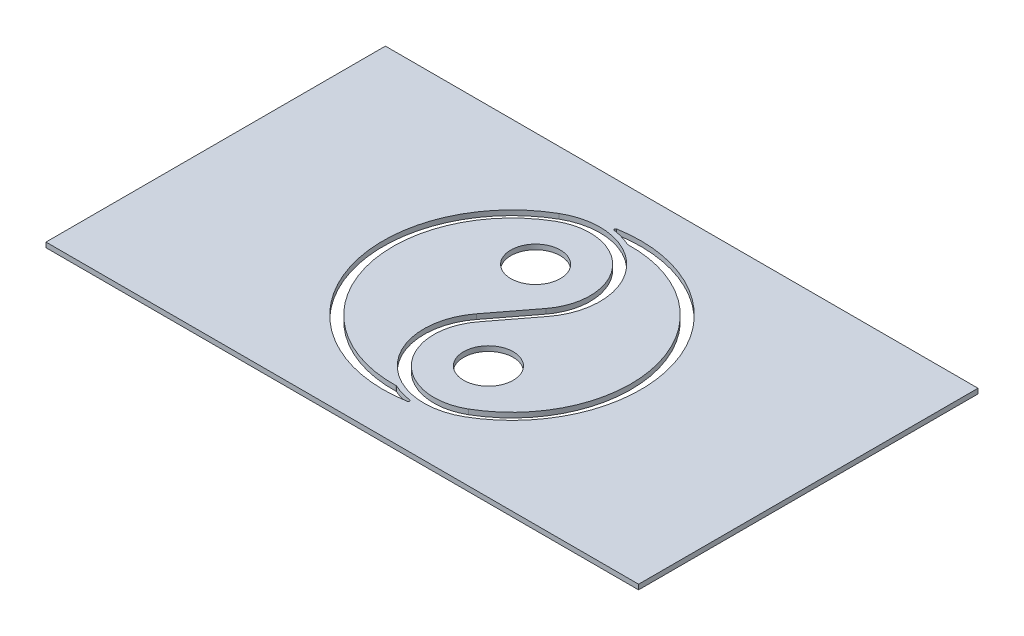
ISO-10303-21;
HEADER;
FILE_DESCRIPTION(('STEP AP214'),'2;1');
FILE_NAME('part.step','',(''),(''),'','','');
FILE_SCHEMA(('AUTOMOTIVE_DESIGN { 1 0 10303 214 1 1 1 1 }'));
ENDSEC;
DATA;
#1=APPLICATION_CONTEXT('core data for automotive mechanical design processes');
#2=APPLICATION_PROTOCOL_DEFINITION('international standard','automotive_design',2000,#1);
#3=PRODUCT_CONTEXT('',#1,'mechanical');
#4=PRODUCT('Part','Part','',(#3));
#5=PRODUCT_RELATED_PRODUCT_CATEGORY('part','',(#4));
#6=PRODUCT_DEFINITION_FORMATION('','',#4);
#7=PRODUCT_DEFINITION_CONTEXT('part definition',#1,'design');
#8=PRODUCT_DEFINITION('design','',#6,#7);
#9=PRODUCT_DEFINITION_SHAPE('','',#8);
#10=(LENGTH_UNIT() NAMED_UNIT(*) SI_UNIT(.MILLI.,.METRE.));
#11=(NAMED_UNIT(*) PLANE_ANGLE_UNIT() SI_UNIT($,.RADIAN.));
#12=(NAMED_UNIT(*) SI_UNIT($,.STERADIAN.) SOLID_ANGLE_UNIT());
#13=UNCERTAINTY_MEASURE_WITH_UNIT(LENGTH_MEASURE(1.E-05),#10,'distance_accuracy_value','');
#14=(GEOMETRIC_REPRESENTATION_CONTEXT(3) GLOBAL_UNCERTAINTY_ASSIGNED_CONTEXT((#13)) GLOBAL_UNIT_ASSIGNED_CONTEXT((#10,
#11,#12)) REPRESENTATION_CONTEXT('',''));
#15=CARTESIAN_POINT('',(0.,0.,0.));
#16=DIRECTION('',(0.,0.,1.));
#17=DIRECTION('',(1.,0.,0.));
#18=AXIS2_PLACEMENT_3D('',#15,#16,#17);
#19=CARTESIAN_POINT('',(0.,1.,0.));
#20=DIRECTION('',(1.,0.,0.));
#21=DIRECTION('',(0.,0.,-1.));
#22=AXIS2_PLACEMENT_3D('',#19,#20,#21);
#23=PLANE('',#22);
#24=DIRECTION('',(0.,0.,1.));
#25=VECTOR('',#24,1.);
#26=CARTESIAN_POINT('',(0.,0.,0.));
#27=LINE('',#26,#25);
#28=CARTESIAN_POINT('',(0.,0.,-68.4505998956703));
#29=VERTEX_POINT('',#28);
#30=CARTESIAN_POINT('',(0.,0.,0.));
#31=VERTEX_POINT('',#30);
#32=EDGE_CURVE('E276',#29,#31,#27,.T.);
#33=ORIENTED_EDGE('',*,*,#32,.T.);
#34=DIRECTION('',(0.,-1.,0.));
#35=VECTOR('',#34,1.);
#36=CARTESIAN_POINT('',(0.,1.,0.));
#37=LINE('',#36,#35);
#38=CARTESIAN_POINT('',(0.,1.,0.));
#39=VERTEX_POINT('',#38);
#40=EDGE_CURVE('E303',#39,#31,#37,.T.);
#41=ORIENTED_EDGE('',*,*,#40,.F.);
#42=DIRECTION('',(0.,0.,1.));
#43=VECTOR('',#42,1.);
#44=CARTESIAN_POINT('',(0.,1.,0.));
#45=LINE('',#44,#43);
#46=CARTESIAN_POINT('',(0.,1.,-68.4505998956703));
#47=VERTEX_POINT('',#46);
#48=EDGE_CURVE('E285',#47,#39,#45,.T.);
#49=ORIENTED_EDGE('',*,*,#48,.F.);
#50=DIRECTION('',(0.,-1.,0.));
#51=VECTOR('',#50,1.);
#52=CARTESIAN_POINT('',(0.,1.,-68.4505998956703));
#53=LINE('',#52,#51);
#54=EDGE_CURVE('E294',#47,#29,#53,.T.);
#55=ORIENTED_EDGE('',*,*,#54,.T.);
#56=EDGE_LOOP('',(#33,#41,#49,#55));
#57=FACE_BOUND('',#56,.T.);
#58=ADVANCED_FACE('F33',(#57),#23,.F.);
#59=CARTESIAN_POINT('',(0.,1.,0.));
#60=DIRECTION('',(0.,0.,-1.));
#61=DIRECTION('',(-1.,0.,0.));
#62=AXIS2_PLACEMENT_3D('',#59,#60,#61);
#63=PLANE('',#62);
#64=DIRECTION('',(1.,0.,0.));
#65=VECTOR('',#64,1.);
#66=CARTESIAN_POINT('',(0.,0.,0.));
#67=LINE('',#66,#65);
#68=CARTESIAN_POINT('',(119.514241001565,0.,0.));
#69=VERTEX_POINT('',#68);
#70=EDGE_CURVE('E279',#31,#69,#67,.T.);
#71=ORIENTED_EDGE('',*,*,#70,.T.);
#72=DIRECTION('',(0.,-1.,0.));
#73=VECTOR('',#72,1.);
#74=CARTESIAN_POINT('',(119.514241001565,1.,0.));
#75=LINE('',#74,#73);
#76=CARTESIAN_POINT('',(119.514241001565,1.,0.));
#77=VERTEX_POINT('',#76);
#78=EDGE_CURVE('E300',#77,#69,#75,.T.);
#79=ORIENTED_EDGE('',*,*,#78,.F.);
#80=DIRECTION('',(1.,0.,0.));
#81=VECTOR('',#80,1.);
#82=CARTESIAN_POINT('',(0.,1.,0.));
#83=LINE('',#82,#81);
#84=EDGE_CURVE('E288',#39,#77,#83,.T.);
#85=ORIENTED_EDGE('',*,*,#84,.F.);
#86=ORIENTED_EDGE('',*,*,#40,.T.);
#87=EDGE_LOOP('',(#71,#79,#85,#86));
#88=FACE_BOUND('',#87,.T.);
#89=ADVANCED_FACE('F364',(#88),#63,.F.);
#90=CARTESIAN_POINT('',(119.514241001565,1.,0.));
#91=DIRECTION('',(-1.,0.,0.));
#92=DIRECTION('',(0.,0.,1.));
#93=AXIS2_PLACEMENT_3D('',#90,#91,#92);
#94=PLANE('',#93);
#95=DIRECTION('',(0.,0.,-1.));
#96=VECTOR('',#95,1.);
#97=CARTESIAN_POINT('',(119.514241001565,0.,0.));
#98=LINE('',#97,#96);
#99=CARTESIAN_POINT('',(119.514241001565,0.,-68.4505998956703));
#100=VERTEX_POINT('',#99);
#101=EDGE_CURVE('E281',#69,#100,#98,.T.);
#102=ORIENTED_EDGE('',*,*,#101,.T.);
#103=DIRECTION('',(0.,-1.,0.));
#104=VECTOR('',#103,1.);
#105=CARTESIAN_POINT('',(119.514241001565,1.,-68.4505998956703));
#106=LINE('',#105,#104);
#107=CARTESIAN_POINT('',(119.514241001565,1.,-68.4505998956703));
#108=VERTEX_POINT('',#107);
#109=EDGE_CURVE('E297',#108,#100,#106,.T.);
#110=ORIENTED_EDGE('',*,*,#109,.F.);
#111=DIRECTION('',(0.,0.,-1.));
#112=VECTOR('',#111,1.);
#113=CARTESIAN_POINT('',(119.514241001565,1.,0.));
#114=LINE('',#113,#112);
#115=EDGE_CURVE('E290',#77,#108,#114,.T.);
#116=ORIENTED_EDGE('',*,*,#115,.F.);
#117=ORIENTED_EDGE('',*,*,#78,.T.);
#118=EDGE_LOOP('',(#102,#110,#116,#117));
#119=FACE_BOUND('',#118,.T.);
#120=ADVANCED_FACE('F369',(#119),#94,.F.);
#121=CARTESIAN_POINT('',(0.,1.,-68.4505998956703));
#122=DIRECTION('',(0.,0.,1.));
#123=DIRECTION('',(1.,0.,0.));
#124=AXIS2_PLACEMENT_3D('',#121,#122,#123);
#125=PLANE('',#124);
#126=DIRECTION('',(-1.,0.,0.));
#127=VECTOR('',#126,1.);
#128=CARTESIAN_POINT('',(0.,0.,-68.4505998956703));
#129=LINE('',#128,#127);
#130=EDGE_CURVE('E283',#100,#29,#129,.T.);
#131=ORIENTED_EDGE('',*,*,#130,.T.);
#132=ORIENTED_EDGE('',*,*,#54,.F.);
#133=DIRECTION('',(-1.,0.,0.));
#134=VECTOR('',#133,1.);
#135=CARTESIAN_POINT('',(0.,1.,-68.4505998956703));
#136=LINE('',#135,#134);
#137=EDGE_CURVE('E292',#108,#47,#136,.T.);
#138=ORIENTED_EDGE('',*,*,#137,.F.);
#139=ORIENTED_EDGE('',*,*,#109,.T.);
#140=EDGE_LOOP('',(#131,#132,#138,#139));
#141=FACE_BOUND('',#140,.T.);
#142=ADVANCED_FACE('F384',(#141),#125,.F.);
#143=CARTESIAN_POINT('',(0.,1.,-68.4505998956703));
#144=DIRECTION('',(0.,-1.,0.));
#145=DIRECTION('',(0.,0.,-1.));
#146=AXIS2_PLACEMENT_3D('',#143,#144,#145);
#147=PLANE('',#146);
#148=DIRECTION('',(0.607100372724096,0.,-0.794625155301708));
#149=VECTOR('',#148,1.);
#150=CARTESIAN_POINT('',(57.5162437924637,1.,-29.6450737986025));
#151=LINE('',#150,#149);
#152=CARTESIAN_POINT('',(57.5162437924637,1.,-29.6450737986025));
#153=VERTEX_POINT('',#152);
#154=CARTESIAN_POINT('',(63.5872475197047,1.,-37.5913253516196));
#155=VERTEX_POINT('',#154);
#156=EDGE_CURVE('E184',#153,#155,#151,.T.);
#157=ORIENTED_EDGE('',*,*,#156,.F.);
#158=CARTESIAN_POINT('',(66.2571205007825,1.,-22.9669696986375));
#159=DIRECTION('',(0.,-1.,0.));
#160=DIRECTION('',(0.,0.,1.));
#161=AXIS2_PLACEMENT_3D('',#158,#159,#160);
#162=CIRCLE('',#161,11.);
#163=CARTESIAN_POINT('',(71.7571205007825,1.,-13.4406902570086));
#164=VERTEX_POINT('',#163);
#165=EDGE_CURVE('E188',#164,#153,#162,.T.);
#166=ORIENTED_EDGE('',*,*,#165,.F.);
#167=CARTESIAN_POINT('',(59.7571205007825,1.,-34.2252999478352));
#168=DIRECTION('',(0.,-1.,0.));
#169=DIRECTION('',(0.,0.,1.));
#170=AXIS2_PLACEMENT_3D('',#167,#168,#169);
#171=CIRCLE('',#170,24.);
#172=CARTESIAN_POINT('',(59.1363829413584,1.,-58.2172712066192));
#173=VERTEX_POINT('',#172);
#174=EDGE_CURVE('E218',#173,#164,#171,.T.);
#175=ORIENTED_EDGE('',*,*,#174,.F.);
#176=CARTESIAN_POINT('',(59.1299169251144,1.,-58.4671875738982));
#177=DIRECTION('',(0.,-1.,0.));
#178=DIRECTION('',(0.,0.,-1.));
#179=AXIS2_PLACEMENT_3D('',#176,#177,#178);
#180=CIRCLE('',#179,0.25);
#181=CARTESIAN_POINT('',(59.026885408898,1.,-58.2394058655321));
#182=VERTEX_POINT('',#181);
#183=EDGE_CURVE('E40',#173,#182,#180,.T.);
#184=ORIENTED_EDGE('',*,*,#183,.T.);
#185=CARTESIAN_POINT('',(53.2571205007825,1.,-45.4836301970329));
#186=DIRECTION('',(0.,-1.,0.));
#187=DIRECTION('',(0.,0.,1.));
#188=AXIS2_PLACEMENT_3D('',#185,#186,#187);
#189=CIRCLE('',#188,14.);
#190=CARTESIAN_POINT('',(55.2635960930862,1.,-59.3391004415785));
#191=VERTEX_POINT('',#190);
#192=EDGE_CURVE('E215',#191,#182,#189,.T.);
#193=ORIENTED_EDGE('',*,*,#192,.F.);
#194=CARTESIAN_POINT('',(55.2994260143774,1.,-59.5865195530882));
#195=DIRECTION('',(0.,-1.,0.));
#196=DIRECTION('',(0.,0.,-1.));
#197=AXIS2_PLACEMENT_3D('',#194,#195,#196);
#198=CIRCLE('',#197,0.25);
#199=CARTESIAN_POINT('',(55.2561474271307,1.,-59.8327449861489));
#200=VERTEX_POINT('',#199);
#201=EDGE_CURVE('E333',#191,#200,#198,.T.);
#202=ORIENTED_EDGE('',*,*,#201,.T.);
#203=CARTESIAN_POINT('',(59.7571205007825,1.,-34.2252999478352));
#204=DIRECTION('',(0.,1.,0.));
#205=DIRECTION('',(0.,0.,1.));
#206=AXIS2_PLACEMENT_3D('',#203,#204,#205);
#207=CIRCLE('',#206,26.);
#208=CARTESIAN_POINT('',(72.7571205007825,1.,-11.7086394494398));
#209=VERTEX_POINT('',#208);
#210=EDGE_CURVE('E212',#209,#200,#207,.T.);
#211=ORIENTED_EDGE('',*,*,#210,.F.);
#212=CARTESIAN_POINT('',(66.2571205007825,1.,-22.9669696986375));
#213=DIRECTION('',(0.,1.,0.));
#214=DIRECTION('',(0.,0.,1.));
#215=AXIS2_PLACEMENT_3D('',#212,#213,#214);
#216=CIRCLE('',#215,13.);
#217=CARTESIAN_POINT('',(55.9269934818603,1.,-30.8592745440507));
#218=VERTEX_POINT('',#217);
#219=EDGE_CURVE('E209',#218,#209,#216,.T.);
#220=ORIENTED_EDGE('',*,*,#219,.F.);
#221=DIRECTION('',(-0.607100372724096,0.,0.794625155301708));
#222=VECTOR('',#221,1.);
#223=CARTESIAN_POINT('',(55.9269934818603,1.,-30.8592745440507));
#224=LINE('',#223,#222);
#225=CARTESIAN_POINT('',(61.9979972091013,1.,-38.8055260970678));
#226=VERTEX_POINT('',#225);
#227=EDGE_CURVE('E206',#226,#218,#224,.T.);
#228=ORIENTED_EDGE('',*,*,#227,.F.);
#229=CARTESIAN_POINT('',(53.2571205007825,1.,-45.4836301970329));
#230=DIRECTION('',(0.,-1.,0.));
#231=DIRECTION('',(0.,0.,1.));
#232=AXIS2_PLACEMENT_3D('',#229,#230,#231);
#233=CIRCLE('',#232,11.);
#234=CARTESIAN_POINT('',(47.7571205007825,1.,-55.0099096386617));
#235=VERTEX_POINT('',#234);
#236=EDGE_CURVE('E203',#235,#226,#233,.T.);
#237=ORIENTED_EDGE('',*,*,#236,.F.);
#238=CARTESIAN_POINT('',(59.7571205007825,1.,-34.2252999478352));
#239=DIRECTION('',(0.,-1.,0.));
#240=DIRECTION('',(0.,0.,1.));
#241=AXIS2_PLACEMENT_3D('',#238,#239,#240);
#242=CIRCLE('',#241,24.);
#243=CARTESIAN_POINT('',(60.3778580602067,1.,-10.2333286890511));
#244=VERTEX_POINT('',#243);
#245=EDGE_CURVE('E201',#244,#235,#242,.T.);
#246=ORIENTED_EDGE('',*,*,#245,.F.);
#247=CARTESIAN_POINT('',(60.3843240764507,1.,-9.9834123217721));
#248=DIRECTION('',(0.,-1.,0.));
#249=DIRECTION('',(0.,0.,-1.));
#250=AXIS2_PLACEMENT_3D('',#247,#248,#249);
#251=CIRCLE('',#250,0.25);
#252=CARTESIAN_POINT('',(60.487355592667,1.,-10.2111940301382));
#253=VERTEX_POINT('',#252);
#254=EDGE_CURVE('E325',#244,#253,#251,.T.);
#255=ORIENTED_EDGE('',*,*,#254,.T.);
#256=CARTESIAN_POINT('',(66.2571205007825,1.,-22.9669696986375));
#257=DIRECTION('',(0.,-1.,0.));
#258=DIRECTION('',(0.,0.,1.));
#259=AXIS2_PLACEMENT_3D('',#256,#257,#258);
#260=CIRCLE('',#259,14.);
#261=CARTESIAN_POINT('',(64.2506449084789,1.,-9.11149945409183));
#262=VERTEX_POINT('',#261);
#263=EDGE_CURVE('E195',#262,#253,#260,.T.);
#264=ORIENTED_EDGE('',*,*,#263,.F.);
#265=CARTESIAN_POINT('',(64.2148149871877,1.,-8.86408034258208));
#266=DIRECTION('',(0.,-1.,0.));
#267=DIRECTION('',(0.,0.,-1.));
#268=AXIS2_PLACEMENT_3D('',#265,#266,#267);
#269=CIRCLE('',#268,0.25);
#270=CARTESIAN_POINT('',(64.2580935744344,1.,-8.61785490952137));
#271=VERTEX_POINT('',#270);
#272=EDGE_CURVE('E329',#262,#271,#269,.T.);
#273=ORIENTED_EDGE('',*,*,#272,.T.);
#274=CARTESIAN_POINT('',(59.7571205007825,1.,-34.2252999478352));
#275=DIRECTION('',(0.,1.,0.));
#276=DIRECTION('',(0.,0.,1.));
#277=AXIS2_PLACEMENT_3D('',#274,#275,#276);
#278=CIRCLE('',#277,26.);
#279=CARTESIAN_POINT('',(46.7571205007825,1.,-56.7419604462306));
#280=VERTEX_POINT('',#279);
#281=EDGE_CURVE('E193',#280,#271,#278,.T.);
#282=ORIENTED_EDGE('',*,*,#281,.F.);
#283=CARTESIAN_POINT('',(53.2571205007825,1.,-45.4836301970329));
#284=DIRECTION('',(0.,1.,0.));
#285=DIRECTION('',(0.,0.,1.));
#286=AXIS2_PLACEMENT_3D('',#283,#284,#285);
#287=CIRCLE('',#286,13.);
#288=EDGE_CURVE('E172',#155,#280,#287,.T.);
#289=ORIENTED_EDGE('',*,*,#288,.F.);
#290=EDGE_LOOP('',(#157,#166,#175,#184,#193,#202,#211,#220,#228,#237,#246,#255,#264,#273,#282,#289));
#291=FACE_BOUND('',#290,.T.);
#292=CARTESIAN_POINT('',(53.2571205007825,1.,-45.4836301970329));
#293=DIRECTION('',(0.,1.,0.));
#294=DIRECTION('',(0.,0.,1.));
#295=AXIS2_PLACEMENT_3D('',#292,#293,#294);
#296=CIRCLE('',#295,5.);
#297=CARTESIAN_POINT('',(53.2571205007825,1.,-40.4836301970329));
#298=VERTEX_POINT('',#297);
#299=EDGE_CURVE('E253',#298,#298,#296,.T.);
#300=ORIENTED_EDGE('',*,*,#299,.F.);
#301=EDGE_LOOP('',(#300));
#302=FACE_BOUND('',#301,.T.);
#303=CARTESIAN_POINT('',(66.2571205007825,1.,-22.9669696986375));
#304=DIRECTION('',(0.,1.,0.));
#305=DIRECTION('',(0.,0.,1.));
#306=AXIS2_PLACEMENT_3D('',#303,#304,#305);
#307=CIRCLE('',#306,5.);
#308=CARTESIAN_POINT('',(66.2571205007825,1.,-17.9669696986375));
#309=VERTEX_POINT('',#308);
#310=EDGE_CURVE('E270',#309,#309,#307,.T.);
#311=ORIENTED_EDGE('',*,*,#310,.F.);
#312=EDGE_LOOP('',(#311));
#313=FACE_BOUND('',#312,.T.);
#314=ORIENTED_EDGE('',*,*,#48,.T.);
#315=ORIENTED_EDGE('',*,*,#84,.T.);
#316=ORIENTED_EDGE('',*,*,#115,.T.);
#317=ORIENTED_EDGE('',*,*,#137,.T.);
#318=EDGE_LOOP('',(#314,#315,#316,#317));
#319=FACE_BOUND('',#318,.T.);
#320=ADVANCED_FACE('F190',(#291,#302,#313,#319),#147,.F.);
#321=CARTESIAN_POINT('',(0.,0.,-68.4505998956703));
#322=DIRECTION('',(0.,-1.,0.));
#323=DIRECTION('',(0.,0.,-1.));
#324=AXIS2_PLACEMENT_3D('',#321,#322,#323);
#325=PLANE('',#324);
#326=CARTESIAN_POINT('',(66.2571205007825,0.,-22.9669696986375));
#327=DIRECTION('',(0.,-1.,0.));
#328=DIRECTION('',(0.,0.,1.));
#329=AXIS2_PLACEMENT_3D('',#326,#327,#328);
#330=CIRCLE('',#329,11.);
#331=CARTESIAN_POINT('',(71.7571205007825,0.,-13.4406902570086));
#332=VERTEX_POINT('',#331);
#333=CARTESIAN_POINT('',(57.5162437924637,0.,-29.6450737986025));
#334=VERTEX_POINT('',#333);
#335=EDGE_CURVE('E220',#332,#334,#330,.T.);
#336=ORIENTED_EDGE('',*,*,#335,.T.);
#337=DIRECTION('',(0.607100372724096,0.,-0.794625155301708));
#338=VECTOR('',#337,1.);
#339=CARTESIAN_POINT('',(57.5162437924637,0.,-29.6450737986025));
#340=LINE('',#339,#338);
#341=CARTESIAN_POINT('',(63.5872475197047,0.,-37.5913253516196));
#342=VERTEX_POINT('',#341);
#343=EDGE_CURVE('E223',#334,#342,#340,.T.);
#344=ORIENTED_EDGE('',*,*,#343,.T.);
#345=CARTESIAN_POINT('',(53.2571205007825,0.,-45.4836301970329));
#346=DIRECTION('',(0.,1.,0.));
#347=DIRECTION('',(0.,0.,1.));
#348=AXIS2_PLACEMENT_3D('',#345,#346,#347);
#349=CIRCLE('',#348,13.);
#350=CARTESIAN_POINT('',(46.7571205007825,0.,-56.7419604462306));
#351=VERTEX_POINT('',#350);
#352=EDGE_CURVE('E175',#342,#351,#349,.T.);
#353=ORIENTED_EDGE('',*,*,#352,.T.);
#354=CARTESIAN_POINT('',(59.7571205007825,0.,-34.2252999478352));
#355=DIRECTION('',(0.,1.,0.));
#356=DIRECTION('',(0.,0.,1.));
#357=AXIS2_PLACEMENT_3D('',#354,#355,#356);
#358=CIRCLE('',#357,26.);
#359=CARTESIAN_POINT('',(64.2580935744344,0.,-8.61785490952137));
#360=VERTEX_POINT('',#359);
#361=EDGE_CURVE('E226',#351,#360,#358,.T.);
#362=ORIENTED_EDGE('',*,*,#361,.T.);
#363=CARTESIAN_POINT('',(64.2148149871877,0.,-8.86408034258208));
#364=DIRECTION('',(0.,-1.,0.));
#365=DIRECTION('',(0.,0.,-1.));
#366=AXIS2_PLACEMENT_3D('',#363,#364,#365);
#367=CIRCLE('',#366,0.25);
#368=CARTESIAN_POINT('',(64.2506449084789,0.,-9.11149945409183));
#369=VERTEX_POINT('',#368);
#370=EDGE_CURVE('E331',#360,#369,#367,.F.);
#371=ORIENTED_EDGE('',*,*,#370,.T.);
#372=CARTESIAN_POINT('',(66.2571205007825,0.,-22.9669696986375));
#373=DIRECTION('',(0.,-1.,0.));
#374=DIRECTION('',(0.,0.,1.));
#375=AXIS2_PLACEMENT_3D('',#372,#373,#374);
#376=CIRCLE('',#375,14.);
#377=CARTESIAN_POINT('',(60.487355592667,0.,-10.2111940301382));
#378=VERTEX_POINT('',#377);
#379=EDGE_CURVE('E229',#369,#378,#376,.T.);
#380=ORIENTED_EDGE('',*,*,#379,.T.);
#381=CARTESIAN_POINT('',(60.3843240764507,0.,-9.9834123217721));
#382=DIRECTION('',(0.,-1.,0.));
#383=DIRECTION('',(0.,0.,-1.));
#384=AXIS2_PLACEMENT_3D('',#381,#382,#383);
#385=CIRCLE('',#384,0.25);
#386=CARTESIAN_POINT('',(60.3778580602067,0.,-10.2333286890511));
#387=VERTEX_POINT('',#386);
#388=EDGE_CURVE('E327',#378,#387,#385,.F.);
#389=ORIENTED_EDGE('',*,*,#388,.T.);
#390=CARTESIAN_POINT('',(59.7571205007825,0.,-34.2252999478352));
#391=DIRECTION('',(0.,-1.,0.));
#392=DIRECTION('',(0.,0.,1.));
#393=AXIS2_PLACEMENT_3D('',#390,#391,#392);
#394=CIRCLE('',#393,24.);
#395=CARTESIAN_POINT('',(47.7571205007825,0.,-55.0099096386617));
#396=VERTEX_POINT('',#395);
#397=EDGE_CURVE('E232',#387,#396,#394,.T.);
#398=ORIENTED_EDGE('',*,*,#397,.T.);
#399=CARTESIAN_POINT('',(53.2571205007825,0.,-45.4836301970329));
#400=DIRECTION('',(0.,-1.,0.));
#401=DIRECTION('',(0.,0.,1.));
#402=AXIS2_PLACEMENT_3D('',#399,#400,#401);
#403=CIRCLE('',#402,11.);
#404=CARTESIAN_POINT('',(61.9979972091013,0.,-38.8055260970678));
#405=VERTEX_POINT('',#404);
#406=EDGE_CURVE('E234',#396,#405,#403,.T.);
#407=ORIENTED_EDGE('',*,*,#406,.T.);
#408=DIRECTION('',(-0.607100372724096,0.,0.794625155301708));
#409=VECTOR('',#408,1.);
#410=CARTESIAN_POINT('',(55.9269934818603,0.,-30.8592745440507));
#411=LINE('',#410,#409);
#412=CARTESIAN_POINT('',(55.9269934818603,0.,-30.8592745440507));
#413=VERTEX_POINT('',#412);
#414=EDGE_CURVE('E237',#405,#413,#411,.T.);
#415=ORIENTED_EDGE('',*,*,#414,.T.);
#416=CARTESIAN_POINT('',(66.2571205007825,0.,-22.9669696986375));
#417=DIRECTION('',(0.,1.,0.));
#418=DIRECTION('',(0.,0.,1.));
#419=AXIS2_PLACEMENT_3D('',#416,#417,#418);
#420=CIRCLE('',#419,13.);
#421=CARTESIAN_POINT('',(72.7571205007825,0.,-11.7086394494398));
#422=VERTEX_POINT('',#421);
#423=EDGE_CURVE('E240',#413,#422,#420,.T.);
#424=ORIENTED_EDGE('',*,*,#423,.T.);
#425=CARTESIAN_POINT('',(59.7571205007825,0.,-34.2252999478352));
#426=DIRECTION('',(0.,1.,0.));
#427=DIRECTION('',(0.,0.,1.));
#428=AXIS2_PLACEMENT_3D('',#425,#426,#427);
#429=CIRCLE('',#428,26.);
#430=CARTESIAN_POINT('',(55.2561474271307,0.,-59.8327449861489));
#431=VERTEX_POINT('',#430);
#432=EDGE_CURVE('E243',#422,#431,#429,.T.);
#433=ORIENTED_EDGE('',*,*,#432,.T.);
#434=CARTESIAN_POINT('',(55.2994260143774,0.,-59.5865195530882));
#435=DIRECTION('',(0.,-1.,0.));
#436=DIRECTION('',(0.,0.,-1.));
#437=AXIS2_PLACEMENT_3D('',#434,#435,#436);
#438=CIRCLE('',#437,0.25);
#439=CARTESIAN_POINT('',(55.2635960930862,0.,-59.3391004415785));
#440=VERTEX_POINT('',#439);
#441=EDGE_CURVE('E335',#431,#440,#438,.F.);
#442=ORIENTED_EDGE('',*,*,#441,.T.);
#443=CARTESIAN_POINT('',(53.2571205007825,0.,-45.4836301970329));
#444=DIRECTION('',(0.,-1.,0.));
#445=DIRECTION('',(0.,0.,1.));
#446=AXIS2_PLACEMENT_3D('',#443,#444,#445);
#447=CIRCLE('',#446,14.);
#448=CARTESIAN_POINT('',(59.026885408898,0.,-58.2394058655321));
#449=VERTEX_POINT('',#448);
#450=EDGE_CURVE('E246',#440,#449,#447,.T.);
#451=ORIENTED_EDGE('',*,*,#450,.T.);
#452=CARTESIAN_POINT('',(59.1299169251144,0.,-58.4671875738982));
#453=DIRECTION('',(0.,-1.,0.));
#454=DIRECTION('',(0.,0.,-1.));
#455=AXIS2_PLACEMENT_3D('',#452,#453,#454);
#456=CIRCLE('',#455,0.25);
#457=CARTESIAN_POINT('',(59.1363829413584,0.,-58.2172712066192));
#458=VERTEX_POINT('',#457);
#459=EDGE_CURVE('E11',#449,#458,#456,.F.);
#460=ORIENTED_EDGE('',*,*,#459,.T.);
#461=CARTESIAN_POINT('',(59.7571205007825,0.,-34.2252999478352));
#462=DIRECTION('',(0.,-1.,0.));
#463=DIRECTION('',(0.,0.,1.));
#464=AXIS2_PLACEMENT_3D('',#461,#462,#463);
#465=CIRCLE('',#464,24.);
#466=EDGE_CURVE('E248',#458,#332,#465,.T.);
#467=ORIENTED_EDGE('',*,*,#466,.T.);
#468=EDGE_LOOP('',(#336,#344,#353,#362,#371,#380,#389,#398,#407,#415,#424,#433,#442,#451,#460,#467));
#469=FACE_BOUND('',#468,.T.);
#470=CARTESIAN_POINT('',(53.2571205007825,0.,-45.4836301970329));
#471=DIRECTION('',(0.,1.,0.));
#472=DIRECTION('',(0.,0.,1.));
#473=AXIS2_PLACEMENT_3D('',#470,#471,#472);
#474=CIRCLE('',#473,5.);
#475=CARTESIAN_POINT('',(53.2571205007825,0.,-40.4836301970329));
#476=VERTEX_POINT('',#475);
#477=EDGE_CURVE('E267',#476,#476,#474,.T.);
#478=ORIENTED_EDGE('',*,*,#477,.T.);
#479=EDGE_LOOP('',(#478));
#480=FACE_BOUND('',#479,.T.);
#481=CARTESIAN_POINT('',(66.2571205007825,0.,-22.9669696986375));
#482=DIRECTION('',(0.,1.,0.));
#483=DIRECTION('',(0.,0.,1.));
#484=AXIS2_PLACEMENT_3D('',#481,#482,#483);
#485=CIRCLE('',#484,5.);
#486=CARTESIAN_POINT('',(66.2571205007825,0.,-17.9669696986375));
#487=VERTEX_POINT('',#486);
#488=EDGE_CURVE('E273',#487,#487,#485,.T.);
#489=ORIENTED_EDGE('',*,*,#488,.T.);
#490=EDGE_LOOP('',(#489));
#491=FACE_BOUND('',#490,.T.);
#492=ORIENTED_EDGE('',*,*,#32,.F.);
#493=ORIENTED_EDGE('',*,*,#130,.F.);
#494=ORIENTED_EDGE('',*,*,#101,.F.);
#495=ORIENTED_EDGE('',*,*,#70,.F.);
#496=EDGE_LOOP('',(#492,#493,#494,#495));
#497=FACE_BOUND('',#496,.T.);
#498=ADVANCED_FACE('F347',(#469,#480,#491,#497),#325,.T.);
#499=CARTESIAN_POINT('',(66.2571205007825,0.,-22.9669696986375));
#500=DIRECTION('',(0.,1.,0.));
#501=DIRECTION('',(0.,0.,1.));
#502=AXIS2_PLACEMENT_3D('',#499,#500,#501);
#503=CYLINDRICAL_SURFACE('',#502,5.);
#504=ORIENTED_EDGE('',*,*,#488,.F.);
#505=EDGE_LOOP('',(#504));
#506=FACE_BOUND('',#505,.T.);
#507=ORIENTED_EDGE('',*,*,#310,.T.);
#508=EDGE_LOOP('',(#507));
#509=FACE_BOUND('',#508,.T.);
#510=ADVANCED_FACE('F359',(#506,#509),#503,.F.);
#511=CARTESIAN_POINT('',(53.2571205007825,0.,-45.4836301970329));
#512=DIRECTION('',(0.,1.,0.));
#513=DIRECTION('',(0.,0.,1.));
#514=AXIS2_PLACEMENT_3D('',#511,#512,#513);
#515=CYLINDRICAL_SURFACE('',#514,5.);
#516=ORIENTED_EDGE('',*,*,#477,.F.);
#517=EDGE_LOOP('',(#516));
#518=FACE_BOUND('',#517,.T.);
#519=ORIENTED_EDGE('',*,*,#299,.T.);
#520=EDGE_LOOP('',(#519));
#521=FACE_BOUND('',#520,.T.);
#522=ADVANCED_FACE('F352',(#518,#521),#515,.F.);
#523=CARTESIAN_POINT('',(66.2571205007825,0.,-22.9669696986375));
#524=DIRECTION('',(0.,1.,0.));
#525=DIRECTION('',(0.,0.,1.));
#526=AXIS2_PLACEMENT_3D('',#523,#524,#525);
#527=CYLINDRICAL_SURFACE('',#526,11.);
#528=ORIENTED_EDGE('',*,*,#165,.T.);
#529=DIRECTION('',(0.,1.,0.));
#530=VECTOR('',#529,1.);
#531=CARTESIAN_POINT('',(57.5162437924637,0.,-29.6450737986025));
#532=LINE('',#531,#530);
#533=EDGE_CURVE('E180',#334,#153,#532,.T.);
#534=ORIENTED_EDGE('',*,*,#533,.F.);
#535=ORIENTED_EDGE('',*,*,#335,.F.);
#536=DIRECTION('',(0.,1.,0.));
#537=VECTOR('',#536,1.);
#538=CARTESIAN_POINT('',(71.7571205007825,0.,-13.4406902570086));
#539=LINE('',#538,#537);
#540=EDGE_CURVE('E250',#332,#164,#539,.T.);
#541=ORIENTED_EDGE('',*,*,#540,.T.);
#542=EDGE_LOOP('',(#528,#534,#535,#541));
#543=FACE_BOUND('',#542,.T.);
#544=ADVANCED_FACE('F350',(#543),#527,.T.);
#545=CARTESIAN_POINT('',(59.7571205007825,0.,-34.2252999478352));
#546=DIRECTION('',(0.,1.,0.));
#547=DIRECTION('',(0.,0.,1.));
#548=AXIS2_PLACEMENT_3D('',#545,#546,#547);
#549=CYLINDRICAL_SURFACE('',#548,24.);
#550=ORIENTED_EDGE('',*,*,#466,.F.);
#551=DIRECTION('',(0.,1.,0.));
#552=VECTOR('',#551,1.);
#553=CARTESIAN_POINT('',(59.1363829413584,0.,-58.2172712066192));
#554=LINE('',#553,#552);
#555=EDGE_CURVE('E323',#458,#173,#554,.T.);
#556=ORIENTED_EDGE('',*,*,#555,.T.);
#557=ORIENTED_EDGE('',*,*,#174,.T.);
#558=ORIENTED_EDGE('',*,*,#540,.F.);
#559=EDGE_LOOP('',(#550,#556,#557,#558));
#560=FACE_BOUND('',#559,.T.);
#561=ADVANCED_FACE('F344',(#560),#549,.T.);
#562=CARTESIAN_POINT('',(53.2571205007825,0.,-45.4836301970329));
#563=DIRECTION('',(0.,1.,0.));
#564=DIRECTION('',(0.,0.,1.));
#565=AXIS2_PLACEMENT_3D('',#562,#563,#564);
#566=CYLINDRICAL_SURFACE('',#565,14.);
#567=ORIENTED_EDGE('',*,*,#450,.F.);
#568=DIRECTION('',(0.,1.,0.));
#569=VECTOR('',#568,1.);
#570=CARTESIAN_POINT('',(55.2635960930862,0.,-59.3391004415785));
#571=LINE('',#570,#569);
#572=EDGE_CURVE('E318',#440,#191,#571,.T.);
#573=ORIENTED_EDGE('',*,*,#572,.T.);
#574=ORIENTED_EDGE('',*,*,#192,.T.);
#575=DIRECTION('',(0.,1.,0.));
#576=VECTOR('',#575,1.);
#577=CARTESIAN_POINT('',(59.026885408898,0.,-58.2394058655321));
#578=LINE('',#577,#576);
#579=EDGE_CURVE('E316',#182,#449,#578,.F.);
#580=ORIENTED_EDGE('',*,*,#579,.T.);
#581=EDGE_LOOP('',(#567,#573,#574,#580));
#582=FACE_BOUND('',#581,.T.);
#583=ADVANCED_FACE('F340',(#582),#566,.T.);
#584=CARTESIAN_POINT('',(59.7571205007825,0.,-34.2252999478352));
#585=DIRECTION('',(0.,1.,0.));
#586=DIRECTION('',(0.,0.,1.));
#587=AXIS2_PLACEMENT_3D('',#584,#585,#586);
#588=CYLINDRICAL_SURFACE('',#587,26.);
#589=ORIENTED_EDGE('',*,*,#210,.T.);
#590=DIRECTION('',(0.,1.,0.));
#591=VECTOR('',#590,1.);
#592=CARTESIAN_POINT('',(55.2561474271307,0.,-59.8327449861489));
#593=LINE('',#592,#591);
#594=EDGE_CURVE('E321',#200,#431,#593,.F.);
#595=ORIENTED_EDGE('',*,*,#594,.T.);
#596=ORIENTED_EDGE('',*,*,#432,.F.);
#597=DIRECTION('',(0.,1.,0.));
#598=VECTOR('',#597,1.);
#599=CARTESIAN_POINT('',(72.7571205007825,0.,-11.7086394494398));
#600=LINE('',#599,#598);
#601=EDGE_CURVE('E254',#422,#209,#600,.T.);
#602=ORIENTED_EDGE('',*,*,#601,.T.);
#603=EDGE_LOOP('',(#589,#595,#596,#602));
#604=FACE_BOUND('',#603,.T.);
#605=ADVANCED_FACE('F429',(#604),#588,.F.);
#606=CARTESIAN_POINT('',(66.2571205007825,0.,-22.9669696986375));
#607=DIRECTION('',(0.,1.,0.));
#608=DIRECTION('',(0.,0.,1.));
#609=AXIS2_PLACEMENT_3D('',#606,#607,#608);
#610=CYLINDRICAL_SURFACE('',#609,13.);
#611=ORIENTED_EDGE('',*,*,#219,.T.);
#612=ORIENTED_EDGE('',*,*,#601,.F.);
#613=ORIENTED_EDGE('',*,*,#423,.F.);
#614=DIRECTION('',(0.,1.,0.));
#615=VECTOR('',#614,1.);
#616=CARTESIAN_POINT('',(55.9269934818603,0.,-30.8592745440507));
#617=LINE('',#616,#615);
#618=EDGE_CURVE('E256',#413,#218,#617,.T.);
#619=ORIENTED_EDGE('',*,*,#618,.T.);
#620=EDGE_LOOP('',(#611,#612,#613,#619));
#621=FACE_BOUND('',#620,.T.);
#622=ADVANCED_FACE('F423',(#621),#610,.F.);
#623=CARTESIAN_POINT('',(55.9269934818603,0.,-30.8592745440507));
#624=DIRECTION('',(-0.794625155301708,0.,-0.607100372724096));
#625=DIRECTION('',(-0.607100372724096,0.,0.794625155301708));
#626=AXIS2_PLACEMENT_3D('',#623,#624,#625);
#627=PLANE('',#626);
#628=ORIENTED_EDGE('',*,*,#227,.T.);
#629=ORIENTED_EDGE('',*,*,#618,.F.);
#630=ORIENTED_EDGE('',*,*,#414,.F.);
#631=DIRECTION('',(0.,1.,0.));
#632=VECTOR('',#631,1.);
#633=CARTESIAN_POINT('',(61.9979972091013,0.,-38.8055260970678));
#634=LINE('',#633,#632);
#635=EDGE_CURVE('E258',#405,#226,#634,.T.);
#636=ORIENTED_EDGE('',*,*,#635,.T.);
#637=EDGE_LOOP('',(#628,#629,#630,#636));
#638=FACE_BOUND('',#637,.T.);
#639=ADVANCED_FACE('F428',(#638),#627,.F.);
#640=CARTESIAN_POINT('',(53.2571205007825,0.,-45.4836301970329));
#641=DIRECTION('',(0.,1.,0.));
#642=DIRECTION('',(0.,0.,1.));
#643=AXIS2_PLACEMENT_3D('',#640,#641,#642);
#644=CYLINDRICAL_SURFACE('',#643,11.);
#645=ORIENTED_EDGE('',*,*,#236,.T.);
#646=ORIENTED_EDGE('',*,*,#635,.F.);
#647=ORIENTED_EDGE('',*,*,#406,.F.);
#648=DIRECTION('',(0.,1.,0.));
#649=VECTOR('',#648,1.);
#650=CARTESIAN_POINT('',(47.7571205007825,0.,-55.0099096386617));
#651=LINE('',#650,#649);
#652=EDGE_CURVE('E260',#396,#235,#651,.T.);
#653=ORIENTED_EDGE('',*,*,#652,.T.);
#654=EDGE_LOOP('',(#645,#646,#647,#653));
#655=FACE_BOUND('',#654,.T.);
#656=ADVANCED_FACE('F441',(#655),#644,.T.);
#657=CARTESIAN_POINT('',(59.7571205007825,0.,-34.2252999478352));
#658=DIRECTION('',(0.,1.,0.));
#659=DIRECTION('',(0.,0.,1.));
#660=AXIS2_PLACEMENT_3D('',#657,#658,#659);
#661=CYLINDRICAL_SURFACE('',#660,24.);
#662=ORIENTED_EDGE('',*,*,#397,.F.);
#663=DIRECTION('',(0.,1.,0.));
#664=VECTOR('',#663,1.);
#665=CARTESIAN_POINT('',(60.3778580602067,0.,-10.2333286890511));
#666=LINE('',#665,#664);
#667=EDGE_CURVE('E306',#387,#244,#666,.T.);
#668=ORIENTED_EDGE('',*,*,#667,.T.);
#669=ORIENTED_EDGE('',*,*,#245,.T.);
#670=ORIENTED_EDGE('',*,*,#652,.F.);
#671=EDGE_LOOP('',(#662,#668,#669,#670));
#672=FACE_BOUND('',#671,.T.);
#673=ADVANCED_FACE('F451',(#672),#661,.T.);
#674=CARTESIAN_POINT('',(66.2571205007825,0.,-22.9669696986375));
#675=DIRECTION('',(0.,1.,0.));
#676=DIRECTION('',(0.,0.,1.));
#677=AXIS2_PLACEMENT_3D('',#674,#675,#676);
#678=CYLINDRICAL_SURFACE('',#677,14.);
#679=ORIENTED_EDGE('',*,*,#263,.T.);
#680=DIRECTION('',(0.,1.,0.));
#681=VECTOR('',#680,1.);
#682=CARTESIAN_POINT('',(60.487355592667,0.,-10.2111940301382));
#683=LINE('',#682,#681);
#684=EDGE_CURVE('E312',#253,#378,#683,.F.);
#685=ORIENTED_EDGE('',*,*,#684,.T.);
#686=ORIENTED_EDGE('',*,*,#379,.F.);
#687=DIRECTION('',(0.,1.,0.));
#688=VECTOR('',#687,1.);
#689=CARTESIAN_POINT('',(64.2506449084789,0.,-9.11149945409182));
#690=LINE('',#689,#688);
#691=EDGE_CURVE('E309',#369,#262,#690,.T.);
#692=ORIENTED_EDGE('',*,*,#691,.T.);
#693=EDGE_LOOP('',(#679,#685,#686,#692));
#694=FACE_BOUND('',#693,.T.);
#695=ADVANCED_FACE('F513',(#694),#678,.T.);
#696=CARTESIAN_POINT('',(59.7571205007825,0.,-34.2252999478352));
#697=DIRECTION('',(0.,1.,0.));
#698=DIRECTION('',(0.,0.,1.));
#699=AXIS2_PLACEMENT_3D('',#696,#697,#698);
#700=CYLINDRICAL_SURFACE('',#699,26.);
#701=ORIENTED_EDGE('',*,*,#281,.T.);
#702=DIRECTION('',(0.,1.,0.));
#703=VECTOR('',#702,1.);
#704=CARTESIAN_POINT('',(64.2580935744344,0.,-8.61785490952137));
#705=LINE('',#704,#703);
#706=EDGE_CURVE('E314',#271,#360,#705,.F.);
#707=ORIENTED_EDGE('',*,*,#706,.T.);
#708=ORIENTED_EDGE('',*,*,#361,.F.);
#709=DIRECTION('',(0.,1.,0.));
#710=VECTOR('',#709,1.);
#711=CARTESIAN_POINT('',(46.7571205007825,0.,-56.7419604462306));
#712=LINE('',#711,#710);
#713=EDGE_CURVE('E179',#351,#280,#712,.T.);
#714=ORIENTED_EDGE('',*,*,#713,.T.);
#715=EDGE_LOOP('',(#701,#707,#708,#714));
#716=FACE_BOUND('',#715,.T.);
#717=ADVANCED_FACE('F463',(#716),#700,.F.);
#718=CARTESIAN_POINT('',(53.2571205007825,0.,-45.4836301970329));
#719=DIRECTION('',(0.,1.,0.));
#720=DIRECTION('',(0.,0.,1.));
#721=AXIS2_PLACEMENT_3D('',#718,#719,#720);
#722=CYLINDRICAL_SURFACE('',#721,13.);
#723=ORIENTED_EDGE('',*,*,#288,.T.);
#724=ORIENTED_EDGE('',*,*,#713,.F.);
#725=ORIENTED_EDGE('',*,*,#352,.F.);
#726=DIRECTION('',(0.,1.,0.));
#727=VECTOR('',#726,1.);
#728=CARTESIAN_POINT('',(63.5872475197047,0.,-37.5913253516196));
#729=LINE('',#728,#727);
#730=EDGE_CURVE('E168',#342,#155,#729,.T.);
#731=ORIENTED_EDGE('',*,*,#730,.T.);
#732=EDGE_LOOP('',(#723,#724,#725,#731));
#733=FACE_BOUND('',#732,.T.);
#734=ADVANCED_FACE('F170',(#733),#722,.F.);
#735=CARTESIAN_POINT('',(57.5162437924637,0.,-29.6450737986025));
#736=DIRECTION('',(0.794625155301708,0.,0.607100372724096));
#737=DIRECTION('',(0.607100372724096,0.,-0.794625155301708));
#738=AXIS2_PLACEMENT_3D('',#735,#736,#737);
#739=PLANE('',#738);
#740=ORIENTED_EDGE('',*,*,#156,.T.);
#741=ORIENTED_EDGE('',*,*,#730,.F.);
#742=ORIENTED_EDGE('',*,*,#343,.F.);
#743=ORIENTED_EDGE('',*,*,#533,.T.);
#744=EDGE_LOOP('',(#740,#741,#742,#743));
#745=FACE_BOUND('',#744,.T.);
#746=ADVANCED_FACE('F185',(#745),#739,.F.);
#747=CARTESIAN_POINT('',(60.3843240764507,0.,-9.9834123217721));
#748=DIRECTION('',(0.,-1.,0.));
#749=DIRECTION('',(0.,0.,-1.));
#750=AXIS2_PLACEMENT_3D('',#747,#748,#749);
#751=CYLINDRICAL_SURFACE('',#750,0.25);
#752=ORIENTED_EDGE('',*,*,#388,.F.);
#753=ORIENTED_EDGE('',*,*,#684,.F.);
#754=ORIENTED_EDGE('',*,*,#254,.F.);
#755=ORIENTED_EDGE('',*,*,#667,.F.);
#756=EDGE_LOOP('',(#752,#753,#754,#755));
#757=FACE_BOUND('',#756,.T.);
#758=ADVANCED_FACE('F474',(#757),#751,.F.);
#759=CARTESIAN_POINT('',(64.2148149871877,0.,-8.86408034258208));
#760=DIRECTION('',(0.,1.,0.));
#761=DIRECTION('',(0.,0.,1.));
#762=AXIS2_PLACEMENT_3D('',#759,#760,#761);
#763=CYLINDRICAL_SURFACE('',#762,0.25);
#764=ORIENTED_EDGE('',*,*,#370,.F.);
#765=ORIENTED_EDGE('',*,*,#706,.F.);
#766=ORIENTED_EDGE('',*,*,#272,.F.);
#767=ORIENTED_EDGE('',*,*,#691,.F.);
#768=EDGE_LOOP('',(#764,#765,#766,#767));
#769=FACE_BOUND('',#768,.T.);
#770=ADVANCED_FACE('F537',(#769),#763,.F.);
#771=CARTESIAN_POINT('',(55.2994260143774,0.,-59.5865195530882));
#772=DIRECTION('',(0.,1.,0.));
#773=DIRECTION('',(0.,0.,1.));
#774=AXIS2_PLACEMENT_3D('',#771,#772,#773);
#775=CYLINDRICAL_SURFACE('',#774,0.25);
#776=ORIENTED_EDGE('',*,*,#441,.F.);
#777=ORIENTED_EDGE('',*,*,#594,.F.);
#778=ORIENTED_EDGE('',*,*,#201,.F.);
#779=ORIENTED_EDGE('',*,*,#572,.F.);
#780=EDGE_LOOP('',(#776,#777,#778,#779));
#781=FACE_BOUND('',#780,.T.);
#782=ADVANCED_FACE('F547',(#781),#775,.F.);
#783=CARTESIAN_POINT('',(59.1299169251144,0.,-58.4671875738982));
#784=DIRECTION('',(0.,-1.,0.));
#785=DIRECTION('',(0.,0.,-1.));
#786=AXIS2_PLACEMENT_3D('',#783,#784,#785);
#787=CYLINDRICAL_SURFACE('',#786,0.25);
#788=ORIENTED_EDGE('',*,*,#459,.F.);
#789=ORIENTED_EDGE('',*,*,#579,.F.);
#790=ORIENTED_EDGE('',*,*,#183,.F.);
#791=ORIENTED_EDGE('',*,*,#555,.F.);
#792=EDGE_LOOP('',(#788,#789,#790,#791));
#793=FACE_BOUND('',#792,.T.);
#794=ADVANCED_FACE('F342',(#793),#787,.F.);
#795=CLOSED_SHELL('',(#58,#89,#120,#142,#320,#498,#510,#522,#544,#561,#583,#605,#622,#639,#656,
#673,#695,#717,#734,#746,#758,#770,#782,#794));
#796=MANIFOLD_SOLID_BREP('B2',#795);
#797=ADVANCED_BREP_SHAPE_REPRESENTATION('',(#18,#796),#14);
#798=SHAPE_DEFINITION_REPRESENTATION(#9,#797);
ENDSEC;
END-ISO-10303-21;
